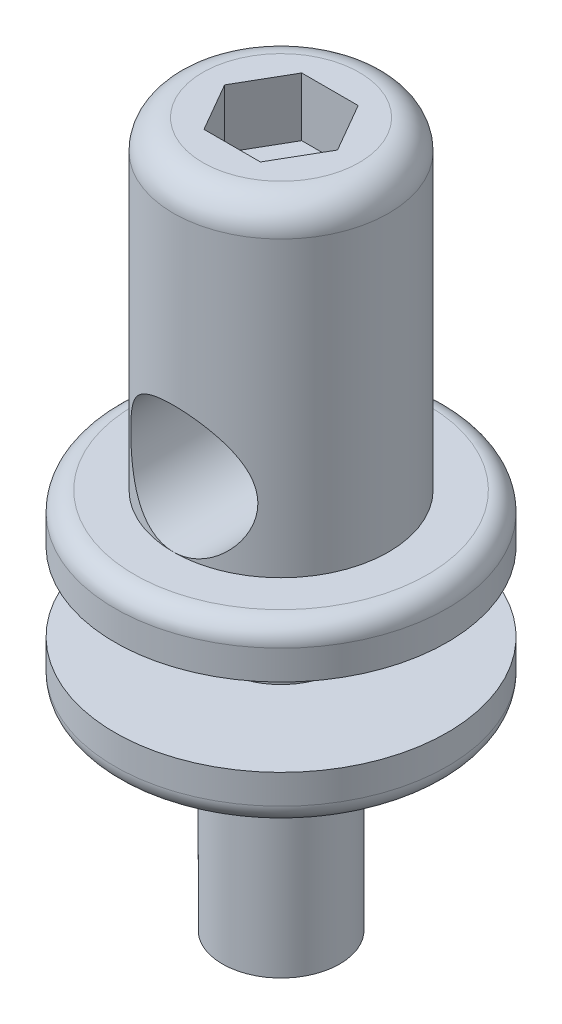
ISO-10303-21;
HEADER;
FILE_DESCRIPTION(('STEP AP214'),'2;1');
FILE_NAME('part.step','',(''),(''),'','','');
FILE_SCHEMA(('AUTOMOTIVE_DESIGN { 1 0 10303 214 1 1 1 1 }'));
ENDSEC;
DATA;
#1=APPLICATION_CONTEXT('core data for automotive mechanical design processes');
#2=APPLICATION_PROTOCOL_DEFINITION('international standard','automotive_design',2000,#1);
#3=PRODUCT_CONTEXT('',#1,'mechanical');
#4=PRODUCT('Part','Part','',(#3));
#5=PRODUCT_RELATED_PRODUCT_CATEGORY('part','',(#4));
#6=PRODUCT_DEFINITION_FORMATION('','',#4);
#7=PRODUCT_DEFINITION_CONTEXT('part definition',#1,'design');
#8=PRODUCT_DEFINITION('design','',#6,#7);
#9=PRODUCT_DEFINITION_SHAPE('','',#8);
#10=(LENGTH_UNIT() NAMED_UNIT(*) SI_UNIT(.MILLI.,.METRE.));
#11=(NAMED_UNIT(*) PLANE_ANGLE_UNIT() SI_UNIT($,.RADIAN.));
#12=(NAMED_UNIT(*) SI_UNIT($,.STERADIAN.) SOLID_ANGLE_UNIT());
#13=UNCERTAINTY_MEASURE_WITH_UNIT(LENGTH_MEASURE(1.E-05),#10,'distance_accuracy_value','');
#14=(GEOMETRIC_REPRESENTATION_CONTEXT(3) GLOBAL_UNCERTAINTY_ASSIGNED_CONTEXT((#13)) GLOBAL_UNIT_ASSIGNED_CONTEXT((#10,
#11,#12)) REPRESENTATION_CONTEXT('',''));
#15=CARTESIAN_POINT('',(0.,0.,0.));
#16=DIRECTION('',(0.,0.,1.));
#17=DIRECTION('',(1.,0.,0.));
#18=AXIS2_PLACEMENT_3D('',#15,#16,#17);
#19=CARTESIAN_POINT('',(0.,-6.5,0.));
#20=DIRECTION('',(0.,-1.,0.));
#21=DIRECTION('',(0.,0.,-1.));
#22=AXIS2_PLACEMENT_3D('',#19,#20,#21);
#23=PLANE('',#22);
#24=CARTESIAN_POINT('',(0.,-6.5,0.));
#25=DIRECTION('',(0.,-1.,0.));
#26=DIRECTION('',(0.,0.,-1.));
#27=AXIS2_PLACEMENT_3D('',#24,#25,#26);
#28=CIRCLE('',#27,7.5);
#29=CARTESIAN_POINT('',(0.,-6.5,-7.5));
#30=VERTEX_POINT('',#29);
#31=EDGE_CURVE('E46',#30,#30,#28,.T.);
#32=ORIENTED_EDGE('',*,*,#31,.T.);
#33=EDGE_LOOP('',(#32));
#34=FACE_BOUND('',#33,.T.);
#35=CARTESIAN_POINT('',(0.,-6.5,0.));
#36=DIRECTION('',(0.,-1.,0.));
#37=DIRECTION('',(0.,0.,-1.));
#38=AXIS2_PLACEMENT_3D('',#35,#36,#37);
#39=CIRCLE('',#38,3.);
#40=CARTESIAN_POINT('',(0.,-6.5,-3.));
#41=VERTEX_POINT('',#40);
#42=EDGE_CURVE('E54',#41,#41,#39,.T.);
#43=ORIENTED_EDGE('',*,*,#42,.F.);
#44=EDGE_LOOP('',(#43));
#45=FACE_BOUND('',#44,.T.);
#46=ADVANCED_FACE('F39',(#34,#45),#23,.T.);
#47=CARTESIAN_POINT('',(0.,-4.,0.));
#48=DIRECTION('',(0.,-1.,0.));
#49=DIRECTION('',(0.,0.,-1.));
#50=AXIS2_PLACEMENT_3D('',#47,#48,#49);
#51=PLANE('',#50);
#52=CARTESIAN_POINT('',(0.,-4.,0.));
#53=DIRECTION('',(0.,-1.,0.));
#54=DIRECTION('',(0.,0.,-1.));
#55=AXIS2_PLACEMENT_3D('',#52,#53,#54);
#56=CIRCLE('',#55,8.5);
#57=CARTESIAN_POINT('',(0.,-4.,-8.5));
#58=VERTEX_POINT('',#57);
#59=EDGE_CURVE('E50',#58,#58,#56,.T.);
#60=ORIENTED_EDGE('',*,*,#59,.F.);
#61=EDGE_LOOP('',(#60));
#62=FACE_BOUND('',#61,.T.);
#63=CARTESIAN_POINT('',(0.,-4.,0.));
#64=DIRECTION('',(0.,-1.,0.));
#65=DIRECTION('',(0.,0.,-1.));
#66=AXIS2_PLACEMENT_3D('',#63,#64,#65);
#67=CIRCLE('',#66,3.);
#68=CARTESIAN_POINT('',(0.,-4.,-3.));
#69=VERTEX_POINT('',#68);
#70=EDGE_CURVE('E59',#69,#69,#67,.T.);
#71=ORIENTED_EDGE('',*,*,#70,.T.);
#72=EDGE_LOOP('',(#71));
#73=FACE_BOUND('',#72,.T.);
#74=ADVANCED_FACE('F63',(#62,#73),#51,.F.);
#75=CARTESIAN_POINT('',(0.,-6.5,0.));
#76=DIRECTION('',(0.,1.,0.));
#77=DIRECTION('',(0.,0.,1.));
#78=AXIS2_PLACEMENT_3D('',#75,#76,#77);
#79=CYLINDRICAL_SURFACE('',#78,8.5);
#80=CARTESIAN_POINT('',(0.,-5.5,0.));
#81=DIRECTION('',(0.,-1.,0.));
#82=DIRECTION('',(0.,0.,-1.));
#83=AXIS2_PLACEMENT_3D('',#80,#81,#82);
#84=CIRCLE('',#83,8.5);
#85=CARTESIAN_POINT('',(0.,-5.5,-8.5));
#86=VERTEX_POINT('',#85);
#87=EDGE_CURVE('E11',#86,#86,#84,.F.);
#88=ORIENTED_EDGE('',*,*,#87,.T.);
#89=EDGE_LOOP('',(#88));
#90=FACE_BOUND('',#89,.T.);
#91=ORIENTED_EDGE('',*,*,#59,.T.);
#92=EDGE_LOOP('',(#91));
#93=FACE_BOUND('',#92,.T.);
#94=ADVANCED_FACE('F41',(#90,#93),#79,.T.);
#95=CARTESIAN_POINT('',(0.,-6.5,0.));
#96=DIRECTION('',(0.,1.,0.));
#97=DIRECTION('',(0.,0.,1.));
#98=AXIS2_PLACEMENT_3D('',#95,#96,#97);
#99=CYLINDRICAL_SURFACE('',#98,3.);
#100=ORIENTED_EDGE('',*,*,#42,.T.);
#101=EDGE_LOOP('',(#100));
#102=FACE_BOUND('',#101,.T.);
#103=ORIENTED_EDGE('',*,*,#70,.F.);
#104=EDGE_LOOP('',(#103));
#105=FACE_BOUND('',#104,.T.);
#106=ADVANCED_FACE('F65',(#102,#105),#99,.F.);
#107=CARTESIAN_POINT('',(0.,-5.5,0.));
#108=DIRECTION('',(0.,-1.,0.));
#109=DIRECTION('',(0.,0.,-1.));
#110=AXIS2_PLACEMENT_3D('',#107,#108,#109);
#111=TOROIDAL_SURFACE('',#110,7.5,1.);
#112=ORIENTED_EDGE('',*,*,#87,.F.);
#113=EDGE_LOOP('',(#112));
#114=FACE_BOUND('',#113,.T.);
#115=ORIENTED_EDGE('',*,*,#31,.F.);
#116=EDGE_LOOP('',(#115));
#117=FACE_BOUND('',#116,.T.);
#118=ADVANCED_FACE('F67',(#114,#117),#111,.T.);
#119=CLOSED_SHELL('',(#46,#74,#94,#106,#118));
#120=MANIFOLD_SOLID_BREP('B2',#119);
#121=CARTESIAN_POINT('',(0.,2.5,0.));
#122=DIRECTION('',(0.,-1.,0.));
#123=DIRECTION('',(0.,0.,-1.));
#124=AXIS2_PLACEMENT_3D('',#121,#122,#123);
#125=CYLINDRICAL_SURFACE('',#124,8.5);
#126=CARTESIAN_POINT('',(0.,1.5,0.));
#127=DIRECTION('',(0.,-1.,0.));
#128=DIRECTION('',(0.,0.,-1.));
#129=AXIS2_PLACEMENT_3D('',#126,#127,#128);
#130=CIRCLE('',#129,8.5);
#131=CARTESIAN_POINT('',(0.,1.5,-8.5));
#132=VERTEX_POINT('',#131);
#133=EDGE_CURVE('E130',#132,#132,#130,.T.);
#134=ORIENTED_EDGE('',*,*,#133,.T.);
#135=EDGE_LOOP('',(#134));
#136=FACE_BOUND('',#135,.T.);
#137=CARTESIAN_POINT('',(0.,0.,0.));
#138=DIRECTION('',(0.,-1.,0.));
#139=DIRECTION('',(0.,0.,-1.));
#140=AXIS2_PLACEMENT_3D('',#137,#138,#139);
#141=CIRCLE('',#140,8.5);
#142=CARTESIAN_POINT('',(0.,0.,-8.5));
#143=VERTEX_POINT('',#142);
#144=EDGE_CURVE('E134',#143,#143,#141,.T.);
#145=ORIENTED_EDGE('',*,*,#144,.F.);
#146=EDGE_LOOP('',(#145));
#147=FACE_BOUND('',#146,.T.);
#148=ADVANCED_FACE('F124',(#136,#147),#125,.T.);
#149=CARTESIAN_POINT('',(0.,2.5,0.));
#150=DIRECTION('',(0.,-1.,0.));
#151=DIRECTION('',(0.,0.,-1.));
#152=AXIS2_PLACEMENT_3D('',#149,#150,#151);
#153=PLANE('',#152);
#154=CARTESIAN_POINT('',(0.,2.5,0.));
#155=DIRECTION('',(0.,-1.,0.));
#156=DIRECTION('',(0.,0.,-1.));
#157=AXIS2_PLACEMENT_3D('',#154,#155,#156);
#158=CIRCLE('',#157,7.5);
#159=CARTESIAN_POINT('',(0.,2.5,-7.5));
#160=VERTEX_POINT('',#159);
#161=EDGE_CURVE('E38',#160,#160,#158,.F.);
#162=ORIENTED_EDGE('',*,*,#161,.T.);
#163=EDGE_LOOP('',(#162));
#164=FACE_BOUND('',#163,.T.);
#165=CARTESIAN_POINT('',(0.,2.5,0.));
#166=DIRECTION('',(0.,-1.,0.));
#167=DIRECTION('',(0.,0.,-1.));
#168=AXIS2_PLACEMENT_3D('',#165,#166,#167);
#169=CIRCLE('',#168,5.5);
#170=CARTESIAN_POINT('',(0.,2.5,-5.5));
#171=VERTEX_POINT('',#170);
#172=EDGE_CURVE('E138',#171,#171,#169,.T.);
#173=ORIENTED_EDGE('',*,*,#172,.T.);
#174=EDGE_LOOP('',(#173));
#175=FACE_BOUND('',#174,.T.);
#176=ADVANCED_FACE('F152',(#164,#175),#153,.F.);
#177=CARTESIAN_POINT('',(0.,0.,0.));
#178=DIRECTION('',(0.,-1.,0.));
#179=DIRECTION('',(0.,0.,-1.));
#180=AXIS2_PLACEMENT_3D('',#177,#178,#179);
#181=PLANE('',#180);
#182=CARTESIAN_POINT('',(0.,0.,0.));
#183=DIRECTION('',(0.,-1.,0.));
#184=DIRECTION('',(0.,0.,-1.));
#185=AXIS2_PLACEMENT_3D('',#182,#183,#184);
#186=CIRCLE('',#185,5.5);
#187=CARTESIAN_POINT('',(0.,0.,-5.5));
#188=VERTEX_POINT('',#187);
#189=EDGE_CURVE('E143',#188,#188,#186,.T.);
#190=ORIENTED_EDGE('',*,*,#189,.F.);
#191=EDGE_LOOP('',(#190));
#192=FACE_BOUND('',#191,.T.);
#193=ORIENTED_EDGE('',*,*,#144,.T.);
#194=EDGE_LOOP('',(#193));
#195=FACE_BOUND('',#194,.T.);
#196=ADVANCED_FACE('F149',(#192,#195),#181,.T.);
#197=CARTESIAN_POINT('',(0.,2.5,0.));
#198=DIRECTION('',(0.,-1.,0.));
#199=DIRECTION('',(0.,0.,-1.));
#200=AXIS2_PLACEMENT_3D('',#197,#198,#199);
#201=CYLINDRICAL_SURFACE('',#200,5.5);
#202=ORIENTED_EDGE('',*,*,#172,.F.);
#203=EDGE_LOOP('',(#202));
#204=FACE_BOUND('',#203,.T.);
#205=ORIENTED_EDGE('',*,*,#189,.T.);
#206=EDGE_LOOP('',(#205));
#207=FACE_BOUND('',#206,.T.);
#208=ADVANCED_FACE('F147',(#204,#207),#201,.F.);
#209=CARTESIAN_POINT('',(0.,1.5,0.));
#210=DIRECTION('',(0.,-1.,0.));
#211=DIRECTION('',(0.,0.,-1.));
#212=AXIS2_PLACEMENT_3D('',#209,#210,#211);
#213=TOROIDAL_SURFACE('',#212,7.5,1.);
#214=ORIENTED_EDGE('',*,*,#161,.F.);
#215=EDGE_LOOP('',(#214));
#216=FACE_BOUND('',#215,.T.);
#217=ORIENTED_EDGE('',*,*,#133,.F.);
#218=EDGE_LOOP('',(#217));
#219=FACE_BOUND('',#218,.T.);
#220=ADVANCED_FACE('F166',(#216,#219),#213,.T.);
#221=CLOSED_SHELL('',(#148,#176,#196,#208,#220));
#222=MANIFOLD_SOLID_BREP('B6',#221);
#223=CARTESIAN_POINT('',(0.,0.,0.));
#224=DIRECTION('',(0.,1.,0.));
#225=DIRECTION('',(0.,0.,1.));
#226=AXIS2_PLACEMENT_3D('',#223,#224,#225);
#227=PLANE('',#226);
#228=CARTESIAN_POINT('',(0.,0.,0.));
#229=DIRECTION('',(0.,1.,0.));
#230=DIRECTION('',(0.,0.,1.));
#231=AXIS2_PLACEMENT_3D('',#228,#229,#230);
#232=CIRCLE('',#231,5.5);
#233=CARTESIAN_POINT('',(0.,0.,5.5));
#234=VERTEX_POINT('',#233);
#235=EDGE_CURVE('E315',#234,#234,#232,.T.);
#236=ORIENTED_EDGE('',*,*,#235,.F.);
#237=EDGE_LOOP('',(#236));
#238=FACE_BOUND('',#237,.T.);
#239=CARTESIAN_POINT('',(0.,0.,0.));
#240=DIRECTION('',(0.,1.,0.));
#241=DIRECTION('',(0.,0.,1.));
#242=AXIS2_PLACEMENT_3D('',#239,#240,#241);
#243=CIRCLE('',#242,3.);
#244=CARTESIAN_POINT('',(0.,0.,3.));
#245=VERTEX_POINT('',#244);
#246=EDGE_CURVE('E318',#245,#245,#243,.F.);
#247=ORIENTED_EDGE('',*,*,#246,.F.);
#248=EDGE_LOOP('',(#247));
#249=FACE_BOUND('',#248,.T.);
#250=ADVANCED_FACE('F200',(#238,#249),#227,.F.);
#251=CARTESIAN_POINT('',(0.,19.,0.));
#252=DIRECTION('',(0.,-1.,0.));
#253=DIRECTION('',(0.,0.,-1.));
#254=AXIS2_PLACEMENT_3D('',#251,#252,#253);
#255=CYLINDRICAL_SURFACE('',#254,5.5);
#256=CARTESIAN_POINT('',(0.,9.,-5.5));
#257=CARTESIAN_POINT('',(-0.0833686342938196,8.99999930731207,-5.49999936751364));
#258=CARTESIAN_POINT('',(-0.166764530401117,8.99678676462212,-5.49809935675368));
#259=CARTESIAN_POINT('',(-0.332929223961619,8.98397755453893,-5.49054506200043));
#260=CARTESIAN_POINT('',(-0.415697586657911,8.9743768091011,-5.48488837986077));
#261=CARTESIAN_POINT('',(-0.580109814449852,8.94889086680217,-5.46994469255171));
#262=CARTESIAN_POINT('',(-0.661751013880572,8.93299277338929,-5.46065023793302));
#263=CARTESIAN_POINT('',(-0.823156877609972,8.89512294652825,-5.43866389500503));
#264=CARTESIAN_POINT('',(-0.902920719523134,8.87314860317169,-5.42597054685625));
#265=CARTESIAN_POINT('',(-1.13773523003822,8.79874762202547,-5.3833710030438));
#266=CARTESIAN_POINT('',(-1.28931583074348,8.73768305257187,-5.34884832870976));
#267=CARTESIAN_POINT('',(-1.57953818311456,8.59495585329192,-5.27045845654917));
#268=CARTESIAN_POINT('',(-1.71818379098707,8.51329938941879,-5.22659405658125));
#269=CARTESIAN_POINT('',(-1.99051108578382,8.32483930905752,-5.12935536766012));
#270=CARTESIAN_POINT('',(-2.12303609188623,8.21660672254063,-5.07551406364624));
#271=CARTESIAN_POINT('',(-2.36917785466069,7.98126662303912,-4.96540292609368));
#272=CARTESIAN_POINT('',(-2.48277043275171,7.85413536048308,-4.90913010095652));
#273=CARTESIAN_POINT('',(-2.70142042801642,7.56690694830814,-4.7926403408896));
#274=CARTESIAN_POINT('',(-2.8038858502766,7.40468973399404,-4.7327423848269));
#275=CARTESIAN_POINT('',(-2.9796948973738,7.06182238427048,-4.62408365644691));
#276=CARTESIAN_POINT('',(-3.05308492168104,6.88120220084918,-4.57530519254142));
#277=CARTESIAN_POINT('',(-3.15356876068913,6.55000744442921,-4.5064184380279));
#278=CARTESIAN_POINT('',(-3.18748949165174,6.4023481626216,-4.48226631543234));
#279=CARTESIAN_POINT('',(-3.23442018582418,6.10217970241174,-4.44852737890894));
#280=CARTESIAN_POINT('',(-3.24745494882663,5.94967649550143,-4.43892329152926));
#281=CARTESIAN_POINT('',(-3.25187121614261,5.64391559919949,-4.43568990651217));
#282=CARTESIAN_POINT('',(-3.24321470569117,5.49065705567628,-4.44208865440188));
#283=CARTESIAN_POINT('',(-3.20470874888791,5.18819547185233,-4.46994159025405));
#284=CARTESIAN_POINT('',(-3.17484378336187,5.03899548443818,-4.49140680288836));
#285=CARTESIAN_POINT('',(-3.09586588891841,4.74980557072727,-4.54619249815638));
#286=CARTESIAN_POINT('',(-3.04694420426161,4.60973979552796,-4.57939489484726));
#287=CARTESIAN_POINT('',(-2.93161593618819,4.33941354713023,-4.6540670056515));
#288=CARTESIAN_POINT('',(-2.86520285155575,4.20915674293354,-4.69553979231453));
#289=CARTESIAN_POINT('',(-2.70372507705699,3.9385827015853,-4.79062113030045));
#290=CARTESIAN_POINT('',(-2.6057073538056,3.80032866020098,-4.8450936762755));
#291=CARTESIAN_POINT('',(-2.38970593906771,3.54084384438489,-4.95520459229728));
#292=CARTESIAN_POINT('',(-2.27170377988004,3.4196290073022,-5.01084399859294));
#293=CARTESIAN_POINT('',(-2.00053312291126,3.1815487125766,-5.12563927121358));
#294=CARTESIAN_POINT('',(-1.84478359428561,3.06732706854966,-5.18430284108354));
#295=CARTESIAN_POINT('',(-1.59598018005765,2.91719851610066,-5.26407557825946));
#296=CARTESIAN_POINT('',(-1.51047637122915,2.87067442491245,-5.28930500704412));
#297=CARTESIAN_POINT('',(-1.3348850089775,2.78519016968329,-5.33632055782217));
#298=CARTESIAN_POINT('',(-1.24480030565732,2.74622537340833,-5.3581087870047));
#299=CARTESIAN_POINT('',(-1.06665933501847,2.67864544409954,-5.3962945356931));
#300=CARTESIAN_POINT('',(-0.978850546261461,2.6495229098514,-5.41295005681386));
#301=CARTESIAN_POINT('',(-0.800477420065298,2.59875796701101,-5.44218660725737));
#302=CARTESIAN_POINT('',(-0.709914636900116,2.57711142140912,-5.45476988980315));
#303=CARTESIAN_POINT('',(-0.526831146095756,2.54163009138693,-5.47548444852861));
#304=CARTESIAN_POINT('',(-0.434311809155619,2.52779001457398,-5.4836187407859));
#305=CARTESIAN_POINT('',(-0.248138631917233,2.50813531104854,-5.49519091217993));
#306=CARTESIAN_POINT('',(-0.154484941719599,2.50231963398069,-5.49862940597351));
#307=CARTESIAN_POINT('',(0.0206896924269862,2.49904580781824,-5.50056379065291));
#308=CARTESIAN_POINT('',(0.102186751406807,2.50058928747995,-5.49965012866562));
#309=CARTESIAN_POINT('',(0.264724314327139,2.50977464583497,-5.49422890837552));
#310=CARTESIAN_POINT('',(0.345764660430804,2.51741851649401,-5.48972017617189));
#311=CARTESIAN_POINT('',(0.587212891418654,2.54938215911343,-5.4709340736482));
#312=CARTESIAN_POINT('',(0.746132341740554,2.58273082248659,-5.4513984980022));
#313=CARTESIAN_POINT('',(1.0522555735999,2.67100565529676,-5.40059701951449));
#314=CARTESIAN_POINT('',(1.19962749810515,2.72549789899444,-5.36956755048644));
#315=CARTESIAN_POINT('',(1.48317090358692,2.8539790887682,-5.29826225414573));
#316=CARTESIAN_POINT('',(1.61934002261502,2.92797213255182,-5.25798448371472));
#317=CARTESIAN_POINT('',(1.89190341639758,3.10197952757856,-5.16657175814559));
#318=CARTESIAN_POINT('',(2.02684330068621,3.20390167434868,-5.11474286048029));
#319=CARTESIAN_POINT('',(2.27874243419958,3.42660845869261,-5.00760526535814));
#320=CARTESIAN_POINT('',(2.39568038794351,3.54741510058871,-4.95229255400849));
#321=CARTESIAN_POINT('',(2.62319164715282,3.82204454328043,-4.83602405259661));
#322=CARTESIAN_POINT('',(2.73116031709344,3.97810529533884,-4.77522298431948));
#323=CARTESIAN_POINT('',(2.91930962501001,4.30907823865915,-4.66258339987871));
#324=CARTESIAN_POINT('',(2.99952244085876,4.48396829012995,-4.61073454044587));
#325=CARTESIAN_POINT('',(3.11464115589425,4.8095060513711,-4.53351350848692));
#326=CARTESIAN_POINT('',(3.15559182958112,4.9572261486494,-4.50484109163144));
#327=CARTESIAN_POINT('',(3.21635056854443,5.25889292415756,-4.46167160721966));
#328=CARTESIAN_POINT('',(3.23618633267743,5.41283116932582,-4.4471559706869));
#329=CARTESIAN_POINT('',(3.25361282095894,5.72315355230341,-4.43442649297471));
#330=CARTESIAN_POINT('',(3.25113345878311,5.8795438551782,-4.43626401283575));
#331=CARTESIAN_POINT('',(3.22392175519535,6.18936739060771,-4.45607313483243));
#332=CARTESIAN_POINT('',(3.19917638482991,6.34279883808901,-4.47405418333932));
#333=CARTESIAN_POINT('',(3.13019310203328,6.6367661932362,-4.52256116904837));
#334=CARTESIAN_POINT('',(3.08672404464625,6.77757011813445,-4.55258937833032));
#335=CARTESIAN_POINT('',(2.98221708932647,7.05007966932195,-4.62172005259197));
#336=CARTESIAN_POINT('',(2.92117259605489,7.18178185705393,-4.66082592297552));
#337=CARTESIAN_POINT('',(2.77237395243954,7.4541428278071,-4.75106422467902));
#338=CARTESIAN_POINT('',(2.68194868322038,7.59303505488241,-4.80312127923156));
#339=CARTESIAN_POINT('',(2.48165486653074,7.85502756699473,-4.9096125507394));
#340=CARTESIAN_POINT('',(2.37177063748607,7.97811497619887,-4.96404865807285));
#341=CARTESIAN_POINT('',(2.11601882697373,8.22404847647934,-5.07886457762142));
#342=CARTESIAN_POINT('',(1.96722437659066,8.34406668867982,-5.13890491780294));
#343=CARTESIAN_POINT('',(1.72834160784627,8.5040074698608,-5.22206900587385));
#344=CARTESIAN_POINT('',(1.64602558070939,8.55400573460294,-5.24865975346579));
#345=CARTESIAN_POINT('',(1.47658080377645,8.64681257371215,-5.29882001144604));
#346=CARTESIAN_POINT('',(1.3894548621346,8.6896252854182,-5.32239125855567));
#347=CARTESIAN_POINT('',(1.21447590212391,8.76600727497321,-5.36496376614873));
#348=CARTESIAN_POINT('',(1.1267883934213,8.7998755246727,-5.3841090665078));
#349=CARTESIAN_POINT('',(0.948145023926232,8.86004747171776,-5.41842079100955));
#350=CARTESIAN_POINT('',(0.857191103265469,8.88635557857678,-5.43358953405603));
#351=CARTESIAN_POINT('',(0.673012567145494,8.93096005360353,-5.45945764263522));
#352=CARTESIAN_POINT('',(0.579795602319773,8.94928027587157,-5.47017031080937));
#353=CARTESIAN_POINT('',(0.391751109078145,8.97770167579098,-5.48684100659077));
#354=CARTESIAN_POINT('',(0.296925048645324,8.98780997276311,-5.49280315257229));
#355=CARTESIAN_POINT('',(0.168214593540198,8.99581858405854,-5.49753007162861));
#356=CARTESIAN_POINT('',(0.134599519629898,8.99738598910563,-5.49845570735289));
#357=CARTESIAN_POINT('',(0.0673244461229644,8.99947684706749,-5.49969080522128));
#358=CARTESIAN_POINT('',(0.033664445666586,9.00000027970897,-5.50000025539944));
#359=CARTESIAN_POINT('',(0.,9.,-5.5));
#360=B_SPLINE_CURVE_WITH_KNOTS('',3,(#256,#257,#258,#259,#260,#261,#262,#263,#264,#265,#266,
#267,#268,#269,#270,#271,#272,#273,#274,#275,#276,#277,#278,#279,#280,#281,#282,#283,#284,#285,
#286,#287,#288,#289,#290,#291,#292,#293,#294,#295,#296,#297,#298,#299,#300,#301,#302,#303,#304,
#305,#306,#307,#308,#309,#310,#311,#312,#313,#314,#315,#316,#317,#318,#319,#320,#321,#322,#323,
#324,#325,#326,#327,#328,#329,#330,#331,#332,#333,#334,#335,#336,#337,#338,#339,#340,#341,#342,
#343,#344,#345,#346,#347,#348,#349,#350,#351,#352,#353,#354,#355,#356,#357,#358,#359),
.UNSPECIFIED.,.T.,.F.,(4,2,2,2,2,2,2,2,2,2,2,2,2,2,2,2,2,2,2,2,2,2,2,2,2,2,2,2,2,2,2,2,2,2,2,2,
2,2,2,2,2,2,2,2,2,2,2,2,2,2,2,4),(0.,0.2500697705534,0.500299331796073,0.751044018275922,
1.00189657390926,1.50056846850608,1.99909121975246,2.53509028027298,3.07176870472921,
3.67182350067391,4.27091681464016,4.72920943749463,5.18695748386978,5.64550831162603,
6.10439502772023,6.55879053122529,7.01335516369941,7.54531582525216,8.07777078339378,
8.67988699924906,8.98120077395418,9.28232932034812,9.56392439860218,9.84536339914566,
10.1266113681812,10.4078225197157,10.6520575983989,10.8963724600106,11.3844563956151,
11.8630123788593,12.3416690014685,12.8701910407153,13.3993335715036,13.9943494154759,
14.5886731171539,15.0545732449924,15.5198614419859,15.9866115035,16.4536348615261,
16.9030773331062,17.3526886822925,17.8718581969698,18.3914480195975,18.9892862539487,
19.2886921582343,19.5879250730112,19.8753048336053,20.1625166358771,20.448864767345,
20.7349643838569,20.8359411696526,20.9369199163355),.UNSPECIFIED.);
#361=CARTESIAN_POINT('',(0.,9.,-5.5));
#362=VERTEX_POINT('',#361);
#363=EDGE_CURVE('E122',#362,#362,#360,.T.);
#364=ORIENTED_EDGE('',*,*,#363,.T.);
#365=EDGE_LOOP('',(#364));
#366=FACE_BOUND('',#365,.T.);
#367=CARTESIAN_POINT('',(3.25,5.75,4.43705983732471));
#368=CARTESIAN_POINT('',(3.25000022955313,5.66795178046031,4.43705951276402));
#369=CARTESIAN_POINT('',(3.24688827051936,5.58590618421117,4.4393440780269));
#370=CARTESIAN_POINT('',(3.23449552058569,5.42250033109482,4.44838139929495));
#371=CARTESIAN_POINT('',(3.22521221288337,5.34114036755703,4.45513597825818));
#372=CARTESIAN_POINT('',(3.20062387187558,5.1797627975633,4.47283302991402));
#373=CARTESIAN_POINT('',(3.18531608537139,5.09974582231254,4.48377741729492));
#374=CARTESIAN_POINT('',(3.14891190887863,4.94163986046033,4.50941754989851));
#375=CARTESIAN_POINT('',(3.12781279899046,4.86355179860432,4.52411505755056));
#376=CARTESIAN_POINT('',(3.05657743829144,4.63405975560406,4.57281516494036));
#377=CARTESIAN_POINT('',(2.99829635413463,4.48611167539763,4.6115842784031));
#378=CARTESIAN_POINT('',(2.86214881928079,4.20227270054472,4.69729225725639));
#379=CARTESIAN_POINT('',(2.78427622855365,4.06638560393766,4.74423368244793));
#380=CARTESIAN_POINT('',(2.60038632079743,3.79277098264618,4.84771826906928));
#381=CARTESIAN_POINT('',(2.49213039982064,3.65672403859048,4.90474054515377));
#382=CARTESIAN_POINT('',(2.25518739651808,3.40334647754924,5.01811054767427));
#383=CARTESIAN_POINT('',(2.12648573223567,3.28602933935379,5.07445776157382));
#384=CARTESIAN_POINT('',(1.83593375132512,3.06134639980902,5.18709391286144));
#385=CARTESIAN_POINT('',(1.67203012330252,2.95627315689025,5.24277120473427));
#386=CARTESIAN_POINT('',(1.41198810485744,2.82111414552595,5.316434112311));
#387=CARTESIAN_POINT('',(1.32291300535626,2.7797935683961,5.33935185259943));
#388=CARTESIAN_POINT('',(1.14060769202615,2.70513654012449,5.38123888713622));
#389=CARTESIAN_POINT('',(1.0473802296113,2.67179489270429,5.40021075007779));
#390=CARTESIAN_POINT('',(0.866333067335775,2.61629837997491,5.43204570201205));
#391=CARTESIAN_POINT('',(0.778813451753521,2.59339290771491,5.44531209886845));
#392=CARTESIAN_POINT('',(0.601703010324,2.55490068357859,5.46771563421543));
#393=CARTESIAN_POINT('',(0.512113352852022,2.53930990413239,5.47685504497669));
#394=CARTESIAN_POINT('',(0.331643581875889,2.51568627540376,5.49073695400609));
#395=CARTESIAN_POINT('',(0.240764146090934,2.50764959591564,5.49548168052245));
#396=CARTESIAN_POINT('',(0.0585588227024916,2.49924592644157,5.50044509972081));
#397=CARTESIAN_POINT('',(-0.0327670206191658,2.49887819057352,5.50066423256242));
#398=CARTESIAN_POINT('',(-0.284150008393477,2.50848959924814,5.49498196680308));
#399=CARTESIAN_POINT('',(-0.443886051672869,2.52651465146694,5.48432022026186));
#400=CARTESIAN_POINT('',(-0.757480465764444,2.58547169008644,5.44987927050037));
#401=CARTESIAN_POINT('',(-0.911338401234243,2.62640536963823,5.42609909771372));
#402=CARTESIAN_POINT('',(-1.21057063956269,2.72969495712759,5.36730180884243));
#403=CARTESIAN_POINT('',(-1.35587957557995,2.79219575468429,5.33220879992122));
#404=CARTESIAN_POINT('',(-1.63413938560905,2.9363411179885,5.25362072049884));
#405=CARTESIAN_POINT('',(-1.76708689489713,3.01799087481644,5.21012337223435));
#406=CARTESIAN_POINT('',(-2.03359625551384,3.20895124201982,5.11242732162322));
#407=CARTESIAN_POINT('',(-2.16539527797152,3.32038458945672,5.05757175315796));
#408=CARTESIAN_POINT('',(-2.4095361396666,3.56225657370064,4.94592776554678));
#409=CARTESIAN_POINT('',(-2.52185204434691,3.6927201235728,4.88913688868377));
#410=CARTESIAN_POINT('',(-2.73636801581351,3.98609062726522,4.77270972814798));
#411=CARTESIAN_POINT('',(-2.83607409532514,4.15099007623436,4.71345378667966));
#412=CARTESIAN_POINT('',(-3.00576993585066,4.49894696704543,4.60710725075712));
#413=CARTESIAN_POINT('',(-3.07581398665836,4.68197047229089,4.55999449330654));
#414=CARTESIAN_POINT('',(-3.16945279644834,5.01555743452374,4.49521848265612));
#415=CARTESIAN_POINT('',(-3.20018350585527,5.16326977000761,4.47318900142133));
#416=CARTESIAN_POINT('',(-3.24081304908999,5.46290902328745,4.44384880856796));
#417=CARTESIAN_POINT('',(-3.25073468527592,5.61483114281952,4.43652198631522));
#418=CARTESIAN_POINT('',(-3.24917901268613,5.91866457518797,4.43766090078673));
#419=CARTESIAN_POINT('',(-3.23767801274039,6.07057569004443,4.44614412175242));
#420=CARTESIAN_POINT('',(-3.19393012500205,6.36985868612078,4.47766766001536));
#421=CARTESIAN_POINT('',(-3.16166721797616,6.51722697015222,4.50071921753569));
#422=CARTESIAN_POINT('',(-3.07784408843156,6.80444783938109,4.55844732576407));
#423=CARTESIAN_POINT('',(-3.02621590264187,6.94427194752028,4.59316477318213));
#424=CARTESIAN_POINT('',(-2.90546701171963,7.21376075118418,4.67048125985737));
#425=CARTESIAN_POINT('',(-2.83633953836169,7.34342149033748,4.7130833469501));
#426=CARTESIAN_POINT('',(-2.66849663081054,7.6130848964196,4.81041473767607));
#427=CARTESIAN_POINT('',(-2.56671477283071,7.75088978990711,4.86595866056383));
#428=CARTESIAN_POINT('',(-2.3429395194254,8.00883964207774,4.97758210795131));
#429=CARTESIAN_POINT('',(-2.22092754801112,8.12896817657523,5.03366207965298));
#430=CARTESIAN_POINT('',(-1.94244222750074,8.36270009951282,5.14801836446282));
#431=CARTESIAN_POINT('',(-1.78359092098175,8.47379358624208,5.20575163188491));
#432=CARTESIAN_POINT('',(-1.53044652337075,8.61874958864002,5.28352030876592));
#433=CARTESIAN_POINT('',(-1.44355215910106,8.66346677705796,5.30797876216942));
#434=CARTESIAN_POINT('',(-1.26531823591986,8.74517276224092,5.35326043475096));
#435=CARTESIAN_POINT('',(-1.17398151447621,8.782166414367,5.37408593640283));
#436=CARTESIAN_POINT('',(-0.994592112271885,8.84542231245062,5.41003846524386));
#437=CARTESIAN_POINT('',(-0.906812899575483,8.87228428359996,5.42547720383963));
#438=CARTESIAN_POINT('',(-0.728748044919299,8.91857737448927,5.45224959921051));
#439=CARTESIAN_POINT('',(-0.638463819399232,8.93801260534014,5.46358552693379));
#440=CARTESIAN_POINT('',(-0.456176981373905,8.96915225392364,5.48181357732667));
#441=CARTESIAN_POINT('',(-0.364175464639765,8.9808614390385,5.48870844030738));
#442=CARTESIAN_POINT('',(-0.17931203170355,8.99637727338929,5.49785705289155));
#443=CARTESIAN_POINT('',(-0.0864502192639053,9.00018486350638,5.50011135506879));
#444=CARTESIAN_POINT('',(0.168283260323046,8.99966041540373,5.49979564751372));
#445=CARTESIAN_POINT('',(0.33023032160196,8.987191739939,5.49240443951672));
#446=CARTESIAN_POINT('',(0.649167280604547,8.93859851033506,5.46390791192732));
#447=CARTESIAN_POINT('',(0.806157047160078,8.90247333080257,5.44280222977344));
#448=CARTESIAN_POINT('',(1.10968893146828,8.80876943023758,5.38907371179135));
#449=CARTESIAN_POINT('',(1.25631959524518,8.75140815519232,5.35656778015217));
#450=CARTESIAN_POINT('',(1.53794694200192,8.61732889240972,5.28260862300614));
#451=CARTESIAN_POINT('',(1.67294084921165,8.54060630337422,5.24115327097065));
#452=CARTESIAN_POINT('',(1.9433744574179,8.36055552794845,5.1474213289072));
#453=CARTESIAN_POINT('',(2.077246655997,8.25523472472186,5.09445701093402));
#454=CARTESIAN_POINT('',(2.32648033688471,8.02568450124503,4.98558210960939));
#455=CARTESIAN_POINT('',(2.44182016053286,7.90143328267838,4.92966817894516));
#456=CARTESIAN_POINT('',(2.66484986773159,7.62005179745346,4.81313009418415));
#457=CARTESIAN_POINT('',(2.76995991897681,7.4607651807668,4.75274610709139));
#458=CARTESIAN_POINT('',(2.95176891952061,7.12335858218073,4.64203004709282));
#459=CARTESIAN_POINT('',(3.0284942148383,6.94525626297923,4.59168867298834));
#460=CARTESIAN_POINT('',(3.11533599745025,6.6797048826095,4.53273428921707));
#461=CARTESIAN_POINT('',(3.13856762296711,6.5980352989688,4.51663473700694));
#462=CARTESIAN_POINT('',(3.17867203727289,6.43248196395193,4.48850174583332));
#463=CARTESIAN_POINT('',(3.19554855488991,6.34859954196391,4.47646592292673));
#464=CARTESIAN_POINT('',(3.22265447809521,6.17934492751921,4.45699196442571));
#465=CARTESIAN_POINT('',(3.232891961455,6.09397467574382,4.44954824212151));
#466=CARTESIAN_POINT('',(3.24656443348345,5.9224019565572,4.43958247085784));
#467=CARTESIAN_POINT('',(3.24999975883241,5.83619953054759,4.43706017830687));
#468=CARTESIAN_POINT('',(3.25,5.75,4.43705983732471));
#469=B_SPLINE_CURVE_WITH_KNOTS('',3,(#367,#368,#369,#370,#371,#372,#373,#374,#375,#376,#377,
#378,#379,#380,#381,#382,#383,#384,#385,#386,#387,#388,#389,#390,#391,#392,#393,#394,#395,#396,
#397,#398,#399,#400,#401,#402,#403,#404,#405,#406,#407,#408,#409,#410,#411,#412,#413,#414,#415,
#416,#417,#418,#419,#420,#421,#422,#423,#424,#425,#426,#427,#428,#429,#430,#431,#432,#433,#434,
#435,#436,#437,#438,#439,#440,#441,#442,#443,#444,#445,#446,#447,#448,#449,#450,#451,#452,#453,
#454,#455,#456,#457,#458,#459,#460,#461,#462,#463,#464,#465,#466,#467,#468),.UNSPECIFIED.,.T.,
.F.,(4,2,2,2,2,2,2,2,2,2,2,2,2,2,2,2,2,2,2,2,2,2,2,2,2,2,2,2,2,2,2,2,2,2,2,2,2,2,2,2,2,2,2,2,2,
2,2,2,2,2,4),(0.,0.246050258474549,0.492200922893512,0.738464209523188,0.984843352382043,
1.47362747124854,1.96256496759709,2.50928854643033,3.05640381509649,3.66023917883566,
3.96234537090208,4.26425427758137,4.53816979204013,4.81193430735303,5.08555993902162,
5.35915895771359,5.83993738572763,6.32075135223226,6.80486046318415,7.28910096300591,
7.83023193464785,8.37207778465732,8.97387173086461,9.57455941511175,10.0300106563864,
10.4849625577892,10.9404178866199,11.396225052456,11.8536470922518,12.3112463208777,
12.8494035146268,13.3880576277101,13.9913050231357,14.2931527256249,14.5948100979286,
14.8736702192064,15.1523757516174,15.4309091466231,15.7094093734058,16.1945711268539,
16.6797457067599,17.1600838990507,17.6405363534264,18.1735604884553,18.7072031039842,
19.3048971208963,19.9020349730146,20.1610148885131,20.4198426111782,20.6783548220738,
20.9368542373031),.UNSPECIFIED.);
#470=CARTESIAN_POINT('',(3.25,5.75,4.43705983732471));
#471=VERTEX_POINT('',#470);
#472=EDGE_CURVE('E212',#471,#471,#469,.T.);
#473=ORIENTED_EDGE('',*,*,#472,.T.);
#474=EDGE_LOOP('',(#473));
#475=FACE_BOUND('',#474,.T.);
#476=CARTESIAN_POINT('',(0.,17.5,0.));
#477=DIRECTION('',(0.,1.,0.));
#478=DIRECTION('',(0.,0.,1.));
#479=AXIS2_PLACEMENT_3D('',#476,#477,#478);
#480=CIRCLE('',#479,5.5);
#481=CARTESIAN_POINT('',(0.,17.5,5.5));
#482=VERTEX_POINT('',#481);
#483=EDGE_CURVE('E324',#482,#482,#480,.F.);
#484=ORIENTED_EDGE('',*,*,#483,.T.);
#485=EDGE_LOOP('',(#484));
#486=FACE_BOUND('',#485,.T.);
#487=ORIENTED_EDGE('',*,*,#235,.T.);
#488=EDGE_LOOP('',(#487));
#489=FACE_BOUND('',#488,.T.);
#490=ADVANCED_FACE('F202',(#366,#475,#486,#489),#255,.T.);
#491=CARTESIAN_POINT('',(0.,19.,0.));
#492=DIRECTION('',(0.,1.,0.));
#493=DIRECTION('',(0.,0.,1.));
#494=AXIS2_PLACEMENT_3D('',#491,#492,#493);
#495=PLANE('',#494);
#496=CARTESIAN_POINT('',(0.,19.,0.));
#497=DIRECTION('',(0.,1.,0.));
#498=DIRECTION('',(0.,0.,1.));
#499=AXIS2_PLACEMENT_3D('',#496,#497,#498);
#500=CIRCLE('',#499,4.);
#501=CARTESIAN_POINT('',(0.,19.,4.));
#502=VERTEX_POINT('',#501);
#503=EDGE_CURVE('E321',#502,#502,#500,.T.);
#504=ORIENTED_EDGE('',*,*,#503,.T.);
#505=EDGE_LOOP('',(#504));
#506=FACE_BOUND('',#505,.T.);
#507=DIRECTION('',(0.5,0.,-0.866025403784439));
#508=VECTOR('',#507,1.);
#509=CARTESIAN_POINT('',(1.44337567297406,19.,2.5));
#510=LINE('',#509,#508);
#511=CARTESIAN_POINT('',(1.44337567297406,19.,2.5));
#512=VERTEX_POINT('',#511);
#513=CARTESIAN_POINT('',(2.88675134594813,19.,0.));
#514=VERTEX_POINT('',#513);
#515=EDGE_CURVE('E219',#512,#514,#510,.T.);
#516=ORIENTED_EDGE('',*,*,#515,.F.);
#517=DIRECTION('',(1.,0.,0.));
#518=VECTOR('',#517,1.);
#519=CARTESIAN_POINT('',(-1.44337567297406,19.,2.5));
#520=LINE('',#519,#518);
#521=CARTESIAN_POINT('',(-1.44337567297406,19.,2.5));
#522=VERTEX_POINT('',#521);
#523=EDGE_CURVE('E288',#522,#512,#520,.T.);
#524=ORIENTED_EDGE('',*,*,#523,.F.);
#525=DIRECTION('',(0.5,0.,0.866025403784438));
#526=VECTOR('',#525,1.);
#527=CARTESIAN_POINT('',(-2.88675134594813,19.,0.));
#528=LINE('',#527,#526);
#529=CARTESIAN_POINT('',(-2.88675134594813,19.,0.));
#530=VERTEX_POINT('',#529);
#531=EDGE_CURVE('E282',#530,#522,#528,.T.);
#532=ORIENTED_EDGE('',*,*,#531,.F.);
#533=DIRECTION('',(-0.5,0.,0.866025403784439));
#534=VECTOR('',#533,1.);
#535=CARTESIAN_POINT('',(-1.44337567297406,19.,-2.5));
#536=LINE('',#535,#534);
#537=CARTESIAN_POINT('',(-1.44337567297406,19.,-2.5));
#538=VERTEX_POINT('',#537);
#539=EDGE_CURVE('E280',#538,#530,#536,.T.);
#540=ORIENTED_EDGE('',*,*,#539,.F.);
#541=DIRECTION('',(-1.,0.,0.));
#542=VECTOR('',#541,1.);
#543=CARTESIAN_POINT('',(1.44337567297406,19.,-2.5));
#544=LINE('',#543,#542);
#545=CARTESIAN_POINT('',(1.44337567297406,19.,-2.5));
#546=VERTEX_POINT('',#545);
#547=EDGE_CURVE('E262',#546,#538,#544,.T.);
#548=ORIENTED_EDGE('',*,*,#547,.F.);
#549=DIRECTION('',(-0.5,0.,-0.866025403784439));
#550=VECTOR('',#549,1.);
#551=CARTESIAN_POINT('',(2.88675134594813,19.,0.));
#552=LINE('',#551,#550);
#553=EDGE_CURVE('E273',#514,#546,#552,.T.);
#554=ORIENTED_EDGE('',*,*,#553,.F.);
#555=EDGE_LOOP('',(#516,#524,#532,#540,#548,#554));
#556=FACE_BOUND('',#555,.T.);
#557=ADVANCED_FACE('F277',(#506,#556),#495,.T.);
#558=CARTESIAN_POINT('',(0.,-17.,0.));
#559=DIRECTION('',(0.,1.,0.));
#560=DIRECTION('',(0.,0.,1.));
#561=AXIS2_PLACEMENT_3D('',#558,#559,#560);
#562=CYLINDRICAL_SURFACE('',#561,3.);
#563=CARTESIAN_POINT('',(0.,-17.,0.));
#564=DIRECTION('',(0.,-1.,0.));
#565=DIRECTION('',(0.,0.,-1.));
#566=AXIS2_PLACEMENT_3D('',#563,#564,#565);
#567=CIRCLE('',#566,3.);
#568=CARTESIAN_POINT('',(0.,-17.,-3.));
#569=VERTEX_POINT('',#568);
#570=EDGE_CURVE('E306',#569,#569,#567,.T.);
#571=ORIENTED_EDGE('',*,*,#570,.F.);
#572=EDGE_LOOP('',(#571));
#573=FACE_BOUND('',#572,.T.);
#574=ORIENTED_EDGE('',*,*,#246,.T.);
#575=EDGE_LOOP('',(#574));
#576=FACE_BOUND('',#575,.T.);
#577=ADVANCED_FACE('F364',(#573,#576),#562,.T.);
#578=CARTESIAN_POINT('',(0.,-17.,0.));
#579=DIRECTION('',(0.,-1.,0.));
#580=DIRECTION('',(0.,0.,-1.));
#581=AXIS2_PLACEMENT_3D('',#578,#579,#580);
#582=PLANE('',#581);
#583=ORIENTED_EDGE('',*,*,#570,.T.);
#584=EDGE_LOOP('',(#583));
#585=FACE_BOUND('',#584,.T.);
#586=ADVANCED_FACE('F361',(#585),#582,.T.);
#587=CARTESIAN_POINT('',(1.44337567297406,16.,2.5));
#588=DIRECTION('',(0.866025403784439,0.,0.5));
#589=DIRECTION('',(0.5,0.,-0.866025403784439));
#590=AXIS2_PLACEMENT_3D('',#587,#588,#589);
#591=PLANE('',#590);
#592=ORIENTED_EDGE('',*,*,#515,.T.);
#593=DIRECTION('',(0.,1.,0.));
#594=VECTOR('',#593,1.);
#595=CARTESIAN_POINT('',(2.88675134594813,16.,0.));
#596=LINE('',#595,#594);
#597=CARTESIAN_POINT('',(2.88675134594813,16.,0.));
#598=VERTEX_POINT('',#597);
#599=EDGE_CURVE('E270',#598,#514,#596,.T.);
#600=ORIENTED_EDGE('',*,*,#599,.F.);
#601=DIRECTION('',(0.5,0.,-0.866025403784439));
#602=VECTOR('',#601,1.);
#603=CARTESIAN_POINT('',(1.44337567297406,16.,2.5));
#604=LINE('',#603,#602);
#605=CARTESIAN_POINT('',(1.44337567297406,16.,2.5));
#606=VERTEX_POINT('',#605);
#607=EDGE_CURVE('E290',#606,#598,#604,.T.);
#608=ORIENTED_EDGE('',*,*,#607,.F.);
#609=DIRECTION('',(0.,1.,0.));
#610=VECTOR('',#609,1.);
#611=CARTESIAN_POINT('',(1.44337567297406,16.,2.5));
#612=LINE('',#611,#610);
#613=EDGE_CURVE('E226',#606,#512,#612,.T.);
#614=ORIENTED_EDGE('',*,*,#613,.T.);
#615=EDGE_LOOP('',(#592,#600,#608,#614));
#616=FACE_BOUND('',#615,.T.);
#617=ADVANCED_FACE('F347',(#616),#591,.F.);
#618=CARTESIAN_POINT('',(-1.44337567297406,16.,2.5));
#619=DIRECTION('',(0.,0.,1.));
#620=DIRECTION('',(1.,0.,0.));
#621=AXIS2_PLACEMENT_3D('',#618,#619,#620);
#622=PLANE('',#621);
#623=ORIENTED_EDGE('',*,*,#523,.T.);
#624=ORIENTED_EDGE('',*,*,#613,.F.);
#625=DIRECTION('',(1.,0.,0.));
#626=VECTOR('',#625,1.);
#627=CARTESIAN_POINT('',(-1.44337567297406,16.,2.5));
#628=LINE('',#627,#626);
#629=CARTESIAN_POINT('',(-1.44337567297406,16.,2.5));
#630=VERTEX_POINT('',#629);
#631=EDGE_CURVE('E302',#630,#606,#628,.T.);
#632=ORIENTED_EDGE('',*,*,#631,.F.);
#633=DIRECTION('',(0.,1.,0.));
#634=VECTOR('',#633,1.);
#635=CARTESIAN_POINT('',(-1.44337567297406,16.,2.5));
#636=LINE('',#635,#634);
#637=EDGE_CURVE('E307',#630,#522,#636,.T.);
#638=ORIENTED_EDGE('',*,*,#637,.T.);
#639=EDGE_LOOP('',(#623,#624,#632,#638));
#640=FACE_BOUND('',#639,.T.);
#641=ADVANCED_FACE('F343',(#640),#622,.F.);
#642=CARTESIAN_POINT('',(-2.88675134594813,16.,0.));
#643=DIRECTION('',(-0.866025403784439,0.,0.5));
#644=DIRECTION('',(0.5,0.,0.866025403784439));
#645=AXIS2_PLACEMENT_3D('',#642,#643,#644);
#646=PLANE('',#645);
#647=ORIENTED_EDGE('',*,*,#531,.T.);
#648=ORIENTED_EDGE('',*,*,#637,.F.);
#649=DIRECTION('',(0.5,0.,0.866025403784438));
#650=VECTOR('',#649,1.);
#651=CARTESIAN_POINT('',(-2.88675134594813,16.,0.));
#652=LINE('',#651,#650);
#653=CARTESIAN_POINT('',(-2.88675134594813,16.,0.));
#654=VERTEX_POINT('',#653);
#655=EDGE_CURVE('E299',#654,#630,#652,.T.);
#656=ORIENTED_EDGE('',*,*,#655,.F.);
#657=DIRECTION('',(0.,1.,0.));
#658=VECTOR('',#657,1.);
#659=CARTESIAN_POINT('',(-2.88675134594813,16.,0.));
#660=LINE('',#659,#658);
#661=EDGE_CURVE('E309',#654,#530,#660,.T.);
#662=ORIENTED_EDGE('',*,*,#661,.T.);
#663=EDGE_LOOP('',(#647,#648,#656,#662));
#664=FACE_BOUND('',#663,.T.);
#665=ADVANCED_FACE('F346',(#664),#646,.F.);
#666=CARTESIAN_POINT('',(-1.44337567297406,16.,-2.5));
#667=DIRECTION('',(-0.866025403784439,0.,-0.5));
#668=DIRECTION('',(-0.5,0.,0.866025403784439));
#669=AXIS2_PLACEMENT_3D('',#666,#667,#668);
#670=PLANE('',#669);
#671=ORIENTED_EDGE('',*,*,#539,.T.);
#672=ORIENTED_EDGE('',*,*,#661,.F.);
#673=DIRECTION('',(-0.5,0.,0.866025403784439));
#674=VECTOR('',#673,1.);
#675=CARTESIAN_POINT('',(-1.44337567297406,16.,-2.5));
#676=LINE('',#675,#674);
#677=CARTESIAN_POINT('',(-1.44337567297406,16.,-2.5));
#678=VERTEX_POINT('',#677);
#679=EDGE_CURVE('E296',#678,#654,#676,.T.);
#680=ORIENTED_EDGE('',*,*,#679,.F.);
#681=DIRECTION('',(0.,1.,0.));
#682=VECTOR('',#681,1.);
#683=CARTESIAN_POINT('',(-1.44337567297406,16.,-2.5));
#684=LINE('',#683,#682);
#685=EDGE_CURVE('E269',#678,#538,#684,.T.);
#686=ORIENTED_EDGE('',*,*,#685,.T.);
#687=EDGE_LOOP('',(#671,#672,#680,#686));
#688=FACE_BOUND('',#687,.T.);
#689=ADVANCED_FACE('F350',(#688),#670,.F.);
#690=CARTESIAN_POINT('',(1.44337567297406,16.,-2.5));
#691=DIRECTION('',(0.,0.,-1.));
#692=DIRECTION('',(-1.,0.,0.));
#693=AXIS2_PLACEMENT_3D('',#690,#691,#692);
#694=PLANE('',#693);
#695=ORIENTED_EDGE('',*,*,#547,.T.);
#696=ORIENTED_EDGE('',*,*,#685,.F.);
#697=DIRECTION('',(-1.,0.,0.));
#698=VECTOR('',#697,1.);
#699=CARTESIAN_POINT('',(1.44337567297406,16.,-2.5));
#700=LINE('',#699,#698);
#701=CARTESIAN_POINT('',(1.44337567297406,16.,-2.5));
#702=VERTEX_POINT('',#701);
#703=EDGE_CURVE('E265',#702,#678,#700,.T.);
#704=ORIENTED_EDGE('',*,*,#703,.F.);
#705=DIRECTION('',(0.,1.,0.));
#706=VECTOR('',#705,1.);
#707=CARTESIAN_POINT('',(1.44337567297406,16.,-2.5));
#708=LINE('',#707,#706);
#709=EDGE_CURVE('E258',#702,#546,#708,.T.);
#710=ORIENTED_EDGE('',*,*,#709,.T.);
#711=EDGE_LOOP('',(#695,#696,#704,#710));
#712=FACE_BOUND('',#711,.T.);
#713=ADVANCED_FACE('F260',(#712),#694,.F.);
#714=CARTESIAN_POINT('',(2.88675134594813,16.,0.));
#715=DIRECTION('',(0.866025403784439,0.,-0.5));
#716=DIRECTION('',(-0.5,0.,-0.866025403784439));
#717=AXIS2_PLACEMENT_3D('',#714,#715,#716);
#718=PLANE('',#717);
#719=ORIENTED_EDGE('',*,*,#553,.T.);
#720=ORIENTED_EDGE('',*,*,#709,.F.);
#721=DIRECTION('',(-0.5,0.,-0.866025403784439));
#722=VECTOR('',#721,1.);
#723=CARTESIAN_POINT('',(2.88675134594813,16.,0.));
#724=LINE('',#723,#722);
#725=EDGE_CURVE('E293',#598,#702,#724,.T.);
#726=ORIENTED_EDGE('',*,*,#725,.F.);
#727=ORIENTED_EDGE('',*,*,#599,.T.);
#728=EDGE_LOOP('',(#719,#720,#726,#727));
#729=FACE_BOUND('',#728,.T.);
#730=ADVANCED_FACE('F274',(#729),#718,.F.);
#731=CARTESIAN_POINT('',(0.,16.,5.));
#732=DIRECTION('',(0.,-1.,0.));
#733=DIRECTION('',(0.,0.,-1.));
#734=AXIS2_PLACEMENT_3D('',#731,#732,#733);
#735=PLANE('',#734);
#736=ORIENTED_EDGE('',*,*,#607,.T.);
#737=ORIENTED_EDGE('',*,*,#725,.T.);
#738=ORIENTED_EDGE('',*,*,#703,.T.);
#739=ORIENTED_EDGE('',*,*,#679,.T.);
#740=ORIENTED_EDGE('',*,*,#655,.T.);
#741=ORIENTED_EDGE('',*,*,#631,.T.);
#742=EDGE_LOOP('',(#736,#737,#738,#739,#740,#741));
#743=FACE_BOUND('',#742,.T.);
#744=ADVANCED_FACE('F338',(#743),#735,.F.);
#745=CARTESIAN_POINT('',(0.,17.5,0.));
#746=DIRECTION('',(0.,1.,0.));
#747=DIRECTION('',(0.,0.,1.));
#748=AXIS2_PLACEMENT_3D('',#745,#746,#747);
#749=TOROIDAL_SURFACE('',#748,4.,1.5);
#750=ORIENTED_EDGE('',*,*,#483,.F.);
#751=EDGE_LOOP('',(#750));
#752=FACE_BOUND('',#751,.T.);
#753=ORIENTED_EDGE('',*,*,#503,.F.);
#754=EDGE_LOOP('',(#753));
#755=FACE_BOUND('',#754,.T.);
#756=ADVANCED_FACE('F333',(#752,#755),#749,.T.);
#757=CARTESIAN_POINT('',(0.,5.75,-5.5));
#758=DIRECTION('',(0.,0.,1.));
#759=DIRECTION('',(1.,0.,0.));
#760=AXIS2_PLACEMENT_3D('',#757,#758,#759);
#761=CYLINDRICAL_SURFACE('',#760,3.25);
#762=ORIENTED_EDGE('',*,*,#472,.F.);
#763=EDGE_LOOP('',(#762));
#764=FACE_BOUND('',#763,.T.);
#765=ORIENTED_EDGE('',*,*,#363,.F.);
#766=EDGE_LOOP('',(#765));
#767=FACE_BOUND('',#766,.T.);
#768=ADVANCED_FACE('F329',(#764,#767),#761,.F.);
#769=CLOSED_SHELL('',(#250,#490,#557,#577,#586,#617,#641,#665,#689,#713,#730,#744,#756,#768));
#770=MANIFOLD_SOLID_BREP('B33',#769);
#771=ADVANCED_BREP_SHAPE_REPRESENTATION('',(#18,#120,#222,#770),#14);
#772=SHAPE_DEFINITION_REPRESENTATION(#9,#771);
ENDSEC;
END-ISO-10303-21;
